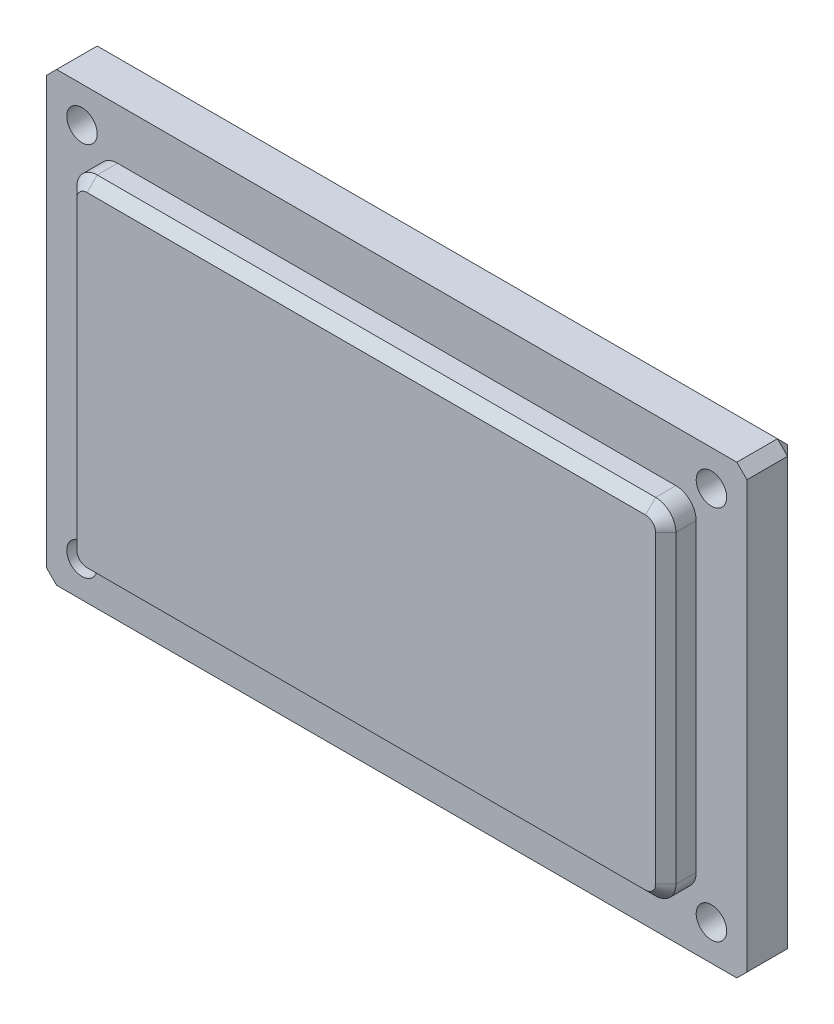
ISO-10303-21;
HEADER;
FILE_DESCRIPTION(('STEP AP214'),'2;1');
FILE_NAME('part.step','',(''),(''),'','','');
FILE_SCHEMA(('AUTOMOTIVE_DESIGN { 1 0 10303 214 1 1 1 1 }'));
ENDSEC;
DATA;
#1=APPLICATION_CONTEXT('core data for automotive mechanical design processes');
#2=APPLICATION_PROTOCOL_DEFINITION('international standard','automotive_design',2000,#1);
#3=PRODUCT_CONTEXT('',#1,'mechanical');
#4=PRODUCT('Part','Part','',(#3));
#5=PRODUCT_RELATED_PRODUCT_CATEGORY('part','',(#4));
#6=PRODUCT_DEFINITION_FORMATION('','',#4);
#7=PRODUCT_DEFINITION_CONTEXT('part definition',#1,'design');
#8=PRODUCT_DEFINITION('design','',#6,#7);
#9=PRODUCT_DEFINITION_SHAPE('','',#8);
#10=(LENGTH_UNIT() NAMED_UNIT(*) SI_UNIT(.MILLI.,.METRE.));
#11=(NAMED_UNIT(*) PLANE_ANGLE_UNIT() SI_UNIT($,.RADIAN.));
#12=(NAMED_UNIT(*) SI_UNIT($,.STERADIAN.) SOLID_ANGLE_UNIT());
#13=UNCERTAINTY_MEASURE_WITH_UNIT(LENGTH_MEASURE(1.E-05),#10,'distance_accuracy_value','');
#14=(GEOMETRIC_REPRESENTATION_CONTEXT(3) GLOBAL_UNCERTAINTY_ASSIGNED_CONTEXT((#13)) GLOBAL_UNIT_ASSIGNED_CONTEXT((#10,
#11,#12)) REPRESENTATION_CONTEXT('',''));
#15=CARTESIAN_POINT('',(0.,0.,0.));
#16=DIRECTION('',(0.,0.,1.));
#17=DIRECTION('',(1.,0.,0.));
#18=AXIS2_PLACEMENT_3D('',#15,#16,#17);
#19=CARTESIAN_POINT('',(34.5,22.,8.));
#20=DIRECTION('',(-1.,0.,0.));
#21=DIRECTION('',(0.,0.,1.));
#22=AXIS2_PLACEMENT_3D('',#19,#20,#21);
#23=PLANE('',#22);
#24=DIRECTION('',(0.,1.,0.));
#25=VECTOR('',#24,1.);
#26=CARTESIAN_POINT('',(34.5,22.,1.00000000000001));
#27=LINE('',#26,#25);
#28=CARTESIAN_POINT('',(34.5,-21.,1.00000000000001));
#29=VERTEX_POINT('',#28);
#30=CARTESIAN_POINT('',(34.5,21.,1.00000000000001));
#31=VERTEX_POINT('',#30);
#32=EDGE_CURVE('E334',#29,#31,#27,.T.);
#33=ORIENTED_EDGE('',*,*,#32,.T.);
#34=DIRECTION('',(0.,0.,1.));
#35=VECTOR('',#34,1.);
#36=CARTESIAN_POINT('',(34.5,21.,8.));
#37=LINE('',#36,#35);
#38=CARTESIAN_POINT('',(34.5,21.,5.));
#39=VERTEX_POINT('',#38);
#40=EDGE_CURVE('E337',#31,#39,#37,.T.);
#41=ORIENTED_EDGE('',*,*,#40,.T.);
#42=DIRECTION('',(0.,1.,0.));
#43=VECTOR('',#42,1.);
#44=CARTESIAN_POINT('',(34.5,22.,5.));
#45=LINE('',#44,#43);
#46=CARTESIAN_POINT('',(34.5,-21.,5.));
#47=VERTEX_POINT('',#46);
#48=EDGE_CURVE('E437',#47,#39,#45,.T.);
#49=ORIENTED_EDGE('',*,*,#48,.F.);
#50=DIRECTION('',(0.,0.,-1.));
#51=VECTOR('',#50,1.);
#52=CARTESIAN_POINT('',(34.5,-21.,8.));
#53=LINE('',#52,#51);
#54=EDGE_CURVE('E331',#47,#29,#53,.T.);
#55=ORIENTED_EDGE('',*,*,#54,.T.);
#56=EDGE_LOOP('',(#33,#41,#49,#55));
#57=FACE_BOUND('',#56,.T.);
#58=ADVANCED_FACE('F43',(#57),#23,.F.);
#59=CARTESIAN_POINT('',(-34.5,22.,8.));
#60=DIRECTION('',(0.,-1.,0.));
#61=DIRECTION('',(0.,0.,-1.));
#62=AXIS2_PLACEMENT_3D('',#59,#60,#61);
#63=PLANE('',#62);
#64=DIRECTION('',(-1.,0.,0.));
#65=VECTOR('',#64,1.);
#66=CARTESIAN_POINT('',(-34.5,22.,1.00000000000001));
#67=LINE('',#66,#65);
#68=CARTESIAN_POINT('',(33.5,22.,1.00000000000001));
#69=VERTEX_POINT('',#68);
#70=CARTESIAN_POINT('',(-33.5,22.,1.00000000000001));
#71=VERTEX_POINT('',#70);
#72=EDGE_CURVE('E300',#69,#71,#67,.T.);
#73=ORIENTED_EDGE('',*,*,#72,.T.);
#74=DIRECTION('',(0.,0.,1.));
#75=VECTOR('',#74,1.);
#76=CARTESIAN_POINT('',(-33.5,22.,8.));
#77=LINE('',#76,#75);
#78=CARTESIAN_POINT('',(-33.5,22.,5.));
#79=VERTEX_POINT('',#78);
#80=EDGE_CURVE('E303',#71,#79,#77,.T.);
#81=ORIENTED_EDGE('',*,*,#80,.T.);
#82=DIRECTION('',(-1.,0.,0.));
#83=VECTOR('',#82,1.);
#84=CARTESIAN_POINT('',(-34.5,22.,5.));
#85=LINE('',#84,#83);
#86=CARTESIAN_POINT('',(33.5,22.,5.));
#87=VERTEX_POINT('',#86);
#88=EDGE_CURVE('E207',#87,#79,#85,.T.);
#89=ORIENTED_EDGE('',*,*,#88,.F.);
#90=DIRECTION('',(0.,0.,-1.));
#91=VECTOR('',#90,1.);
#92=CARTESIAN_POINT('',(33.5,22.,8.));
#93=LINE('',#92,#91);
#94=EDGE_CURVE('E297',#87,#69,#93,.T.);
#95=ORIENTED_EDGE('',*,*,#94,.T.);
#96=EDGE_LOOP('',(#73,#81,#89,#95));
#97=FACE_BOUND('',#96,.T.);
#98=ADVANCED_FACE('F572',(#97),#63,.F.);
#99=CARTESIAN_POINT('',(-34.5,22.,8.));
#100=DIRECTION('',(1.,0.,0.));
#101=DIRECTION('',(0.,0.,-1.));
#102=AXIS2_PLACEMENT_3D('',#99,#100,#101);
#103=PLANE('',#102);
#104=DIRECTION('',(0.,-1.,0.));
#105=VECTOR('',#104,1.);
#106=CARTESIAN_POINT('',(-34.5,-22.,5.));
#107=LINE('',#106,#105);
#108=CARTESIAN_POINT('',(-34.5,21.,5.));
#109=VERTEX_POINT('',#108);
#110=CARTESIAN_POINT('',(-34.5,-21.,5.));
#111=VERTEX_POINT('',#110);
#112=EDGE_CURVE('E438',#109,#111,#107,.T.);
#113=ORIENTED_EDGE('',*,*,#112,.F.);
#114=DIRECTION('',(0.,0.,-1.));
#115=VECTOR('',#114,1.);
#116=CARTESIAN_POINT('',(-34.5,21.,8.));
#117=LINE('',#116,#115);
#118=CARTESIAN_POINT('',(-34.5,21.,1.00000000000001));
#119=VERTEX_POINT('',#118);
#120=EDGE_CURVE('E293',#109,#119,#117,.T.);
#121=ORIENTED_EDGE('',*,*,#120,.T.);
#122=DIRECTION('',(0.,-1.,0.));
#123=VECTOR('',#122,1.);
#124=CARTESIAN_POINT('',(-34.5,22.,1.00000000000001));
#125=LINE('',#124,#123);
#126=CARTESIAN_POINT('',(-34.5,-21.,1.00000000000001));
#127=VERTEX_POINT('',#126);
#128=EDGE_CURVE('E287',#119,#127,#125,.T.);
#129=ORIENTED_EDGE('',*,*,#128,.T.);
#130=DIRECTION('',(0.,0.,1.));
#131=VECTOR('',#130,1.);
#132=CARTESIAN_POINT('',(-34.5,-21.,8.));
#133=LINE('',#132,#131);
#134=EDGE_CURVE('E290',#127,#111,#133,.T.);
#135=ORIENTED_EDGE('',*,*,#134,.T.);
#136=EDGE_LOOP('',(#113,#121,#129,#135));
#137=FACE_BOUND('',#136,.T.);
#138=ADVANCED_FACE('F578',(#137),#103,.F.);
#139=CARTESIAN_POINT('',(-34.5,-22.,8.));
#140=DIRECTION('',(0.,1.,0.));
#141=DIRECTION('',(0.,0.,1.));
#142=AXIS2_PLACEMENT_3D('',#139,#140,#141);
#143=PLANE('',#142);
#144=DIRECTION('',(1.,0.,0.));
#145=VECTOR('',#144,1.);
#146=CARTESIAN_POINT('',(-34.5,-22.,1.00000000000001));
#147=LINE('',#146,#145);
#148=CARTESIAN_POINT('',(-33.5,-22.,1.00000000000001));
#149=VERTEX_POINT('',#148);
#150=CARTESIAN_POINT('',(33.5,-22.,1.00000000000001));
#151=VERTEX_POINT('',#150);
#152=EDGE_CURVE('E54',#149,#151,#147,.T.);
#153=ORIENTED_EDGE('',*,*,#152,.T.);
#154=DIRECTION('',(0.,0.,1.));
#155=VECTOR('',#154,1.);
#156=CARTESIAN_POINT('',(33.5,-22.,8.));
#157=LINE('',#156,#155);
#158=CARTESIAN_POINT('',(33.5,-22.,5.));
#159=VERTEX_POINT('',#158);
#160=EDGE_CURVE('E11',#151,#159,#157,.T.);
#161=ORIENTED_EDGE('',*,*,#160,.T.);
#162=DIRECTION('',(1.,0.,0.));
#163=VECTOR('',#162,1.);
#164=CARTESIAN_POINT('',(34.5,-22.,5.));
#165=LINE('',#164,#163);
#166=CARTESIAN_POINT('',(-33.5,-22.,5.));
#167=VERTEX_POINT('',#166);
#168=EDGE_CURVE('E430',#167,#159,#165,.T.);
#169=ORIENTED_EDGE('',*,*,#168,.F.);
#170=DIRECTION('',(0.,0.,-1.));
#171=VECTOR('',#170,1.);
#172=CARTESIAN_POINT('',(-33.5,-22.,8.));
#173=LINE('',#172,#171);
#174=EDGE_CURVE('E65',#167,#149,#173,.T.);
#175=ORIENTED_EDGE('',*,*,#174,.T.);
#176=EDGE_LOOP('',(#153,#161,#169,#175));
#177=FACE_BOUND('',#176,.T.);
#178=ADVANCED_FACE('F429',(#177),#143,.F.);
#179=CARTESIAN_POINT('',(0.,0.,0.));
#180=DIRECTION('',(0.,0.,1.));
#181=DIRECTION('',(1.,0.,0.));
#182=AXIS2_PLACEMENT_3D('',#179,#180,#181);
#183=PLANE('',#182);
#184=DIRECTION('',(0.,1.,0.));
#185=VECTOR('',#184,1.);
#186=CARTESIAN_POINT('',(-33.5,0.,0.));
#187=LINE('',#186,#185);
#188=CARTESIAN_POINT('',(-33.5,-21.,0.));
#189=VERTEX_POINT('',#188);
#190=CARTESIAN_POINT('',(-33.5,21.,0.));
#191=VERTEX_POINT('',#190);
#192=EDGE_CURVE('E318',#189,#191,#187,.T.);
#193=ORIENTED_EDGE('',*,*,#192,.T.);
#194=DIRECTION('',(1.,0.,0.));
#195=VECTOR('',#194,1.);
#196=CARTESIAN_POINT('',(0.,21.,0.));
#197=LINE('',#196,#195);
#198=CARTESIAN_POINT('',(33.5,21.,0.));
#199=VERTEX_POINT('',#198);
#200=EDGE_CURVE('E327',#191,#199,#197,.T.);
#201=ORIENTED_EDGE('',*,*,#200,.T.);
#202=DIRECTION('',(0.,-1.,0.));
#203=VECTOR('',#202,1.);
#204=CARTESIAN_POINT('',(33.5,0.,0.));
#205=LINE('',#204,#203);
#206=CARTESIAN_POINT('',(33.5,-21.,0.));
#207=VERTEX_POINT('',#206);
#208=EDGE_CURVE('E324',#199,#207,#205,.T.);
#209=ORIENTED_EDGE('',*,*,#208,.T.);
#210=DIRECTION('',(-1.,0.,0.));
#211=VECTOR('',#210,1.);
#212=CARTESIAN_POINT('',(0.,-21.,0.));
#213=LINE('',#212,#211);
#214=EDGE_CURVE('E321',#207,#189,#213,.T.);
#215=ORIENTED_EDGE('',*,*,#214,.T.);
#216=EDGE_LOOP('',(#193,#201,#209,#215));
#217=FACE_BOUND('',#216,.T.);
#218=CARTESIAN_POINT('',(-31.,-18.5,0.));
#219=DIRECTION('',(0.,0.,1.));
#220=DIRECTION('',(-1.,0.,0.));
#221=AXIS2_PLACEMENT_3D('',#218,#219,#220);
#222=CIRCLE('',#221,1.5);
#223=CARTESIAN_POINT('',(-32.5,-18.5,0.));
#224=VERTEX_POINT('',#223);
#225=EDGE_CURVE('E516',#224,#224,#222,.T.);
#226=ORIENTED_EDGE('',*,*,#225,.T.);
#227=EDGE_LOOP('',(#226));
#228=FACE_BOUND('',#227,.T.);
#229=CARTESIAN_POINT('',(31.,18.5,0.));
#230=DIRECTION('',(0.,0.,1.));
#231=DIRECTION('',(-1.,0.,0.));
#232=AXIS2_PLACEMENT_3D('',#229,#230,#231);
#233=CIRCLE('',#232,1.50000000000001);
#234=CARTESIAN_POINT('',(29.5,18.5,0.));
#235=VERTEX_POINT('',#234);
#236=EDGE_CURVE('E524',#235,#235,#233,.T.);
#237=ORIENTED_EDGE('',*,*,#236,.T.);
#238=EDGE_LOOP('',(#237));
#239=FACE_BOUND('',#238,.T.);
#240=CARTESIAN_POINT('',(31.,-18.5,0.));
#241=DIRECTION('',(0.,0.,1.));
#242=DIRECTION('',(1.,0.,0.));
#243=AXIS2_PLACEMENT_3D('',#240,#241,#242);
#244=CIRCLE('',#243,1.50000000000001);
#245=CARTESIAN_POINT('',(32.5,-18.5,0.));
#246=VERTEX_POINT('',#245);
#247=EDGE_CURVE('E525',#246,#246,#244,.T.);
#248=ORIENTED_EDGE('',*,*,#247,.T.);
#249=EDGE_LOOP('',(#248));
#250=FACE_BOUND('',#249,.T.);
#251=CARTESIAN_POINT('',(-31.,18.5,0.));
#252=DIRECTION('',(0.,0.,1.));
#253=DIRECTION('',(1.,0.,0.));
#254=AXIS2_PLACEMENT_3D('',#251,#252,#253);
#255=CIRCLE('',#254,1.5);
#256=CARTESIAN_POINT('',(-29.5,18.5,0.));
#257=VERTEX_POINT('',#256);
#258=EDGE_CURVE('E511',#257,#257,#255,.T.);
#259=ORIENTED_EDGE('',*,*,#258,.T.);
#260=EDGE_LOOP('',(#259));
#261=FACE_BOUND('',#260,.T.);
#262=ADVANCED_FACE('F543',(#217,#228,#239,#250,#261),#183,.F.);
#263=CARTESIAN_POINT('',(0.,0.,5.));
#264=DIRECTION('',(0.,0.,-1.));
#265=DIRECTION('',(-1.,0.,0.));
#266=AXIS2_PLACEMENT_3D('',#263,#264,#265);
#267=PLANE('',#266);
#268=CARTESIAN_POINT('',(-31.,-18.5,5.));
#269=DIRECTION('',(0.,0.,1.));
#270=DIRECTION('',(-1.,0.,0.));
#271=AXIS2_PLACEMENT_3D('',#268,#269,#270);
#272=CIRCLE('',#271,1.5);
#273=CARTESIAN_POINT('',(-32.5,-18.5,5.));
#274=VERTEX_POINT('',#273);
#275=EDGE_CURVE('E529',#274,#274,#272,.T.);
#276=ORIENTED_EDGE('',*,*,#275,.F.);
#277=EDGE_LOOP('',(#276));
#278=FACE_BOUND('',#277,.T.);
#279=CARTESIAN_POINT('',(31.,18.5,5.));
#280=DIRECTION('',(0.,0.,1.));
#281=DIRECTION('',(-1.,0.,0.));
#282=AXIS2_PLACEMENT_3D('',#279,#280,#281);
#283=CIRCLE('',#282,1.50000000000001);
#284=CARTESIAN_POINT('',(29.5,18.5,5.));
#285=VERTEX_POINT('',#284);
#286=EDGE_CURVE('E520',#285,#285,#283,.T.);
#287=ORIENTED_EDGE('',*,*,#286,.F.);
#288=EDGE_LOOP('',(#287));
#289=FACE_BOUND('',#288,.T.);
#290=CARTESIAN_POINT('',(31.,-18.5,5.));
#291=DIRECTION('',(0.,0.,1.));
#292=DIRECTION('',(1.,0.,0.));
#293=AXIS2_PLACEMENT_3D('',#290,#291,#292);
#294=CIRCLE('',#293,1.50000000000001);
#295=CARTESIAN_POINT('',(32.5,-18.5,5.));
#296=VERTEX_POINT('',#295);
#297=EDGE_CURVE('E374',#296,#296,#294,.T.);
#298=ORIENTED_EDGE('',*,*,#297,.F.);
#299=EDGE_LOOP('',(#298));
#300=FACE_BOUND('',#299,.T.);
#301=CARTESIAN_POINT('',(-31.,18.5,5.));
#302=DIRECTION('',(0.,0.,1.));
#303=DIRECTION('',(1.,0.,0.));
#304=AXIS2_PLACEMENT_3D('',#301,#302,#303);
#305=CIRCLE('',#304,1.5);
#306=CARTESIAN_POINT('',(-29.5,18.5,5.));
#307=VERTEX_POINT('',#306);
#308=EDGE_CURVE('E512',#307,#307,#305,.T.);
#309=ORIENTED_EDGE('',*,*,#308,.F.);
#310=EDGE_LOOP('',(#309));
#311=FACE_BOUND('',#310,.T.);
#312=DIRECTION('',(0.,-1.,0.));
#313=VECTOR('',#312,1.);
#314=CARTESIAN_POINT('',(-29.5,17.,5.));
#315=LINE('',#314,#313);
#316=CARTESIAN_POINT('',(-29.5,15.,5.));
#317=VERTEX_POINT('',#316);
#318=CARTESIAN_POINT('',(-29.5,-15.,5.));
#319=VERTEX_POINT('',#318);
#320=EDGE_CURVE('E220',#317,#319,#315,.T.);
#321=ORIENTED_EDGE('',*,*,#320,.F.);
#322=CARTESIAN_POINT('',(-27.5,15.,5.));
#323=DIRECTION('',(0.,0.,-1.));
#324=DIRECTION('',(-1.,0.,0.));
#325=AXIS2_PLACEMENT_3D('',#322,#323,#324);
#326=CIRCLE('',#325,2.);
#327=CARTESIAN_POINT('',(-27.5,17.,5.));
#328=VERTEX_POINT('',#327);
#329=EDGE_CURVE('E227',#317,#328,#326,.T.);
#330=ORIENTED_EDGE('',*,*,#329,.T.);
#331=DIRECTION('',(-1.,0.,0.));
#332=VECTOR('',#331,1.);
#333=CARTESIAN_POINT('',(-29.5,17.,5.));
#334=LINE('',#333,#332);
#335=CARTESIAN_POINT('',(27.5,17.,5.));
#336=VERTEX_POINT('',#335);
#337=EDGE_CURVE('E443',#336,#328,#334,.T.);
#338=ORIENTED_EDGE('',*,*,#337,.F.);
#339=CARTESIAN_POINT('',(27.5,15.,5.));
#340=DIRECTION('',(0.,0.,-1.));
#341=DIRECTION('',(-1.,0.,0.));
#342=AXIS2_PLACEMENT_3D('',#339,#340,#341);
#343=CIRCLE('',#342,2.);
#344=CARTESIAN_POINT('',(29.5,15.,5.));
#345=VERTEX_POINT('',#344);
#346=EDGE_CURVE('E231',#336,#345,#343,.T.);
#347=ORIENTED_EDGE('',*,*,#346,.T.);
#348=DIRECTION('',(0.,1.,0.));
#349=VECTOR('',#348,1.);
#350=CARTESIAN_POINT('',(29.5,17.,5.));
#351=LINE('',#350,#349);
#352=CARTESIAN_POINT('',(29.5,-15.,5.));
#353=VERTEX_POINT('',#352);
#354=EDGE_CURVE('E219',#353,#345,#351,.T.);
#355=ORIENTED_EDGE('',*,*,#354,.F.);
#356=CARTESIAN_POINT('',(27.5,-15.,5.));
#357=DIRECTION('',(0.,0.,-1.));
#358=DIRECTION('',(-1.,0.,0.));
#359=AXIS2_PLACEMENT_3D('',#356,#357,#358);
#360=CIRCLE('',#359,2.);
#361=CARTESIAN_POINT('',(27.5,-17.,5.));
#362=VERTEX_POINT('',#361);
#363=EDGE_CURVE('E217',#353,#362,#360,.T.);
#364=ORIENTED_EDGE('',*,*,#363,.T.);
#365=DIRECTION('',(1.,0.,0.));
#366=VECTOR('',#365,1.);
#367=CARTESIAN_POINT('',(-29.5,-17.,5.));
#368=LINE('',#367,#366);
#369=CARTESIAN_POINT('',(-27.5,-17.,5.));
#370=VERTEX_POINT('',#369);
#371=EDGE_CURVE('E197',#370,#362,#368,.T.);
#372=ORIENTED_EDGE('',*,*,#371,.F.);
#373=CARTESIAN_POINT('',(-27.5,-15.,5.));
#374=DIRECTION('',(0.,0.,-1.));
#375=DIRECTION('',(-1.,0.,0.));
#376=AXIS2_PLACEMENT_3D('',#373,#374,#375);
#377=CIRCLE('',#376,2.);
#378=EDGE_CURVE('E213',#370,#319,#377,.T.);
#379=ORIENTED_EDGE('',*,*,#378,.T.);
#380=EDGE_LOOP('',(#321,#330,#338,#347,#355,#364,#372,#379));
#381=FACE_BOUND('',#380,.T.);
#382=ORIENTED_EDGE('',*,*,#88,.T.);
#383=DIRECTION('',(0.707106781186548,0.707106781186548,0.));
#384=VECTOR('',#383,1.);
#385=CARTESIAN_POINT('',(-34.5,21.,5.));
#386=LINE('',#385,#384);
#387=EDGE_CURVE('E315',#79,#109,#386,.F.);
#388=ORIENTED_EDGE('',*,*,#387,.T.);
#389=ORIENTED_EDGE('',*,*,#112,.T.);
#390=DIRECTION('',(-0.707106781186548,0.707106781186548,0.));
#391=VECTOR('',#390,1.);
#392=CARTESIAN_POINT('',(-33.5,-22.,5.));
#393=LINE('',#392,#391);
#394=EDGE_CURVE('E306',#111,#167,#393,.F.);
#395=ORIENTED_EDGE('',*,*,#394,.T.);
#396=ORIENTED_EDGE('',*,*,#168,.T.);
#397=DIRECTION('',(-0.707106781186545,-0.70710678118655,0.));
#398=VECTOR('',#397,1.);
#399=CARTESIAN_POINT('',(34.5,-21.,5.));
#400=LINE('',#399,#398);
#401=EDGE_CURVE('E309',#159,#47,#400,.F.);
#402=ORIENTED_EDGE('',*,*,#401,.T.);
#403=ORIENTED_EDGE('',*,*,#48,.T.);
#404=DIRECTION('',(0.707106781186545,-0.70710678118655,0.));
#405=VECTOR('',#404,1.);
#406=CARTESIAN_POINT('',(33.5,22.,5.));
#407=LINE('',#406,#405);
#408=EDGE_CURVE('E312',#39,#87,#407,.F.);
#409=ORIENTED_EDGE('',*,*,#408,.T.);
#410=EDGE_LOOP('',(#382,#388,#389,#395,#396,#402,#403,#409));
#411=FACE_BOUND('',#410,.T.);
#412=ADVANCED_FACE('F211',(#278,#289,#300,#311,#381,#411),#267,.F.);
#413=CARTESIAN_POINT('',(-29.5,17.,5.));
#414=DIRECTION('',(-1.,0.,0.));
#415=DIRECTION('',(0.,-1.,0.));
#416=AXIS2_PLACEMENT_3D('',#413,#414,#415);
#417=PLANE('',#416);
#418=DIRECTION('',(0.,0.,1.));
#419=VECTOR('',#418,1.);
#420=CARTESIAN_POINT('',(-29.5,-15.,5.));
#421=LINE('',#420,#419);
#422=CARTESIAN_POINT('',(-29.5,-15.,7.00000000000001));
#423=VERTEX_POINT('',#422);
#424=EDGE_CURVE('E225',#319,#423,#421,.T.);
#425=ORIENTED_EDGE('',*,*,#424,.T.);
#426=DIRECTION('',(0.,1.,0.));
#427=VECTOR('',#426,1.);
#428=CARTESIAN_POINT('',(-29.5,17.,7.00000000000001));
#429=LINE('',#428,#427);
#430=CARTESIAN_POINT('',(-29.5,15.,7.00000000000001));
#431=VERTEX_POINT('',#430);
#432=EDGE_CURVE('E267',#423,#431,#429,.T.);
#433=ORIENTED_EDGE('',*,*,#432,.T.);
#434=DIRECTION('',(0.,0.,1.));
#435=VECTOR('',#434,1.);
#436=CARTESIAN_POINT('',(-29.5,15.,5.));
#437=LINE('',#436,#435);
#438=EDGE_CURVE('E458',#431,#317,#437,.F.);
#439=ORIENTED_EDGE('',*,*,#438,.T.);
#440=ORIENTED_EDGE('',*,*,#320,.T.);
#441=EDGE_LOOP('',(#425,#433,#439,#440));
#442=FACE_BOUND('',#441,.T.);
#443=ADVANCED_FACE('F556',(#442),#417,.T.);
#444=CARTESIAN_POINT('',(-29.5,17.,5.));
#445=DIRECTION('',(0.,1.,0.));
#446=DIRECTION('',(0.,0.,1.));
#447=AXIS2_PLACEMENT_3D('',#444,#445,#446);
#448=PLANE('',#447);
#449=DIRECTION('',(0.,0.,1.));
#450=VECTOR('',#449,1.);
#451=CARTESIAN_POINT('',(-27.5,17.,5.));
#452=LINE('',#451,#450);
#453=CARTESIAN_POINT('',(-27.5,17.,7.00000000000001));
#454=VERTEX_POINT('',#453);
#455=EDGE_CURVE('E233',#328,#454,#452,.T.);
#456=ORIENTED_EDGE('',*,*,#455,.T.);
#457=DIRECTION('',(1.,0.,0.));
#458=VECTOR('',#457,1.);
#459=CARTESIAN_POINT('',(-29.5,17.,7.00000000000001));
#460=LINE('',#459,#458);
#461=CARTESIAN_POINT('',(27.5,17.,7.00000000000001));
#462=VERTEX_POINT('',#461);
#463=EDGE_CURVE('E273',#454,#462,#460,.T.);
#464=ORIENTED_EDGE('',*,*,#463,.T.);
#465=DIRECTION('',(0.,0.,1.));
#466=VECTOR('',#465,1.);
#467=CARTESIAN_POINT('',(27.5,17.,5.));
#468=LINE('',#467,#466);
#469=EDGE_CURVE('E463',#462,#336,#468,.F.);
#470=ORIENTED_EDGE('',*,*,#469,.T.);
#471=ORIENTED_EDGE('',*,*,#337,.T.);
#472=EDGE_LOOP('',(#456,#464,#470,#471));
#473=FACE_BOUND('',#472,.T.);
#474=ADVANCED_FACE('F471',(#473),#448,.T.);
#475=CARTESIAN_POINT('',(29.5,17.,5.));
#476=DIRECTION('',(1.,0.,0.));
#477=DIRECTION('',(0.,0.,-1.));
#478=AXIS2_PLACEMENT_3D('',#475,#476,#477);
#479=PLANE('',#478);
#480=DIRECTION('',(0.,0.,1.));
#481=VECTOR('',#480,1.);
#482=CARTESIAN_POINT('',(29.5,15.,5.));
#483=LINE('',#482,#481);
#484=CARTESIAN_POINT('',(29.5,15.,7.00000000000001));
#485=VERTEX_POINT('',#484);
#486=EDGE_CURVE('E451',#345,#485,#483,.T.);
#487=ORIENTED_EDGE('',*,*,#486,.T.);
#488=DIRECTION('',(0.,-1.,0.));
#489=VECTOR('',#488,1.);
#490=CARTESIAN_POINT('',(29.5,17.,7.00000000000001));
#491=LINE('',#490,#489);
#492=CARTESIAN_POINT('',(29.5,-15.,7.00000000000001));
#493=VERTEX_POINT('',#492);
#494=EDGE_CURVE('E279',#485,#493,#491,.T.);
#495=ORIENTED_EDGE('',*,*,#494,.T.);
#496=DIRECTION('',(0.,0.,1.));
#497=VECTOR('',#496,1.);
#498=CARTESIAN_POINT('',(29.5,-15.,5.));
#499=LINE('',#498,#497);
#500=EDGE_CURVE('E455',#493,#353,#499,.F.);
#501=ORIENTED_EDGE('',*,*,#500,.T.);
#502=ORIENTED_EDGE('',*,*,#354,.T.);
#503=EDGE_LOOP('',(#487,#495,#501,#502));
#504=FACE_BOUND('',#503,.T.);
#505=ADVANCED_FACE('F503',(#504),#479,.T.);
#506=CARTESIAN_POINT('',(-29.5,-17.,5.));
#507=DIRECTION('',(0.,-1.,0.));
#508=DIRECTION('',(1.,0.,0.));
#509=AXIS2_PLACEMENT_3D('',#506,#507,#508);
#510=PLANE('',#509);
#511=DIRECTION('',(0.,0.,1.));
#512=VECTOR('',#511,1.);
#513=CARTESIAN_POINT('',(27.5,-17.,5.));
#514=LINE('',#513,#512);
#515=CARTESIAN_POINT('',(27.5,-17.,7.00000000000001));
#516=VERTEX_POINT('',#515);
#517=EDGE_CURVE('E206',#362,#516,#514,.T.);
#518=ORIENTED_EDGE('',*,*,#517,.T.);
#519=DIRECTION('',(-1.,0.,0.));
#520=VECTOR('',#519,1.);
#521=CARTESIAN_POINT('',(-29.5,-17.,7.00000000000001));
#522=LINE('',#521,#520);
#523=CARTESIAN_POINT('',(-27.5,-17.,7.00000000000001));
#524=VERTEX_POINT('',#523);
#525=EDGE_CURVE('E200',#516,#524,#522,.T.);
#526=ORIENTED_EDGE('',*,*,#525,.T.);
#527=DIRECTION('',(0.,0.,1.));
#528=VECTOR('',#527,1.);
#529=CARTESIAN_POINT('',(-27.5,-17.,5.));
#530=LINE('',#529,#528);
#531=EDGE_CURVE('E193',#524,#370,#530,.F.);
#532=ORIENTED_EDGE('',*,*,#531,.T.);
#533=ORIENTED_EDGE('',*,*,#371,.T.);
#534=EDGE_LOOP('',(#518,#526,#532,#533));
#535=FACE_BOUND('',#534,.T.);
#536=ADVANCED_FACE('F196',(#535),#510,.T.);
#537=CARTESIAN_POINT('',(0.,0.,8.));
#538=DIRECTION('',(0.,0.,1.));
#539=DIRECTION('',(1.,0.,0.));
#540=AXIS2_PLACEMENT_3D('',#537,#538,#539);
#541=PLANE('',#540);
#542=DIRECTION('',(0.,-1.,0.));
#543=VECTOR('',#542,1.);
#544=CARTESIAN_POINT('',(-28.5,0.,8.));
#545=LINE('',#544,#543);
#546=CARTESIAN_POINT('',(-28.5,15.,8.));
#547=VERTEX_POINT('',#546);
#548=CARTESIAN_POINT('',(-28.5,-15.,8.));
#549=VERTEX_POINT('',#548);
#550=EDGE_CURVE('E257',#547,#549,#545,.T.);
#551=ORIENTED_EDGE('',*,*,#550,.T.);
#552=CARTESIAN_POINT('',(-27.5,-15.,8.));
#553=DIRECTION('',(0.,0.,1.));
#554=DIRECTION('',(1.,0.,0.));
#555=AXIS2_PLACEMENT_3D('',#552,#553,#554);
#556=CIRCLE('',#555,1.00000000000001);
#557=CARTESIAN_POINT('',(-27.5,-16.,8.));
#558=VERTEX_POINT('',#557);
#559=EDGE_CURVE('E260',#549,#558,#556,.T.);
#560=ORIENTED_EDGE('',*,*,#559,.T.);
#561=DIRECTION('',(1.,0.,0.));
#562=VECTOR('',#561,1.);
#563=CARTESIAN_POINT('',(0.,-16.,8.));
#564=LINE('',#563,#562);
#565=CARTESIAN_POINT('',(27.5,-16.,8.));
#566=VERTEX_POINT('',#565);
#567=EDGE_CURVE('E239',#558,#566,#564,.T.);
#568=ORIENTED_EDGE('',*,*,#567,.T.);
#569=CARTESIAN_POINT('',(27.5,-15.,8.));
#570=DIRECTION('',(0.,0.,1.));
#571=DIRECTION('',(1.,0.,0.));
#572=AXIS2_PLACEMENT_3D('',#569,#570,#571);
#573=CIRCLE('',#572,1.00000000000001);
#574=CARTESIAN_POINT('',(28.5,-15.,8.));
#575=VERTEX_POINT('',#574);
#576=EDGE_CURVE('E242',#566,#575,#573,.T.);
#577=ORIENTED_EDGE('',*,*,#576,.T.);
#578=DIRECTION('',(0.,1.,0.));
#579=VECTOR('',#578,1.);
#580=CARTESIAN_POINT('',(28.5,0.,8.));
#581=LINE('',#580,#579);
#582=CARTESIAN_POINT('',(28.5,15.,8.));
#583=VERTEX_POINT('',#582);
#584=EDGE_CURVE('E245',#575,#583,#581,.T.);
#585=ORIENTED_EDGE('',*,*,#584,.T.);
#586=CARTESIAN_POINT('',(27.5,15.,8.));
#587=DIRECTION('',(0.,0.,1.));
#588=DIRECTION('',(1.,0.,0.));
#589=AXIS2_PLACEMENT_3D('',#586,#587,#588);
#590=CIRCLE('',#589,1.00000000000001);
#591=CARTESIAN_POINT('',(27.5,16.,8.));
#592=VERTEX_POINT('',#591);
#593=EDGE_CURVE('E248',#583,#592,#590,.T.);
#594=ORIENTED_EDGE('',*,*,#593,.T.);
#595=DIRECTION('',(-1.,0.,0.));
#596=VECTOR('',#595,1.);
#597=CARTESIAN_POINT('',(0.,16.,8.));
#598=LINE('',#597,#596);
#599=CARTESIAN_POINT('',(-27.5,16.,8.));
#600=VERTEX_POINT('',#599);
#601=EDGE_CURVE('E251',#592,#600,#598,.T.);
#602=ORIENTED_EDGE('',*,*,#601,.T.);
#603=CARTESIAN_POINT('',(-27.5,15.,8.));
#604=DIRECTION('',(0.,0.,1.));
#605=DIRECTION('',(1.,0.,0.));
#606=AXIS2_PLACEMENT_3D('',#603,#604,#605);
#607=CIRCLE('',#606,1.00000000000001);
#608=EDGE_CURVE('E254',#600,#547,#607,.T.);
#609=ORIENTED_EDGE('',*,*,#608,.T.);
#610=EDGE_LOOP('',(#551,#560,#568,#577,#585,#594,#602,#609));
#611=FACE_BOUND('',#610,.T.);
#612=ADVANCED_FACE('F488',(#611),#541,.T.);
#613=CARTESIAN_POINT('',(-31.,18.5,0.));
#614=DIRECTION('',(0.,0.,1.));
#615=DIRECTION('',(1.,0.,0.));
#616=AXIS2_PLACEMENT_3D('',#613,#614,#615);
#617=CYLINDRICAL_SURFACE('',#616,1.5);
#618=ORIENTED_EDGE('',*,*,#258,.F.);
#619=EDGE_LOOP('',(#618));
#620=FACE_BOUND('',#619,.T.);
#621=ORIENTED_EDGE('',*,*,#308,.T.);
#622=EDGE_LOOP('',(#621));
#623=FACE_BOUND('',#622,.T.);
#624=ADVANCED_FACE('F550',(#620,#623),#617,.F.);
#625=CARTESIAN_POINT('',(31.,-18.5,0.));
#626=DIRECTION('',(0.,0.,1.));
#627=DIRECTION('',(1.,0.,0.));
#628=AXIS2_PLACEMENT_3D('',#625,#626,#627);
#629=CYLINDRICAL_SURFACE('',#628,1.50000000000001);
#630=ORIENTED_EDGE('',*,*,#247,.F.);
#631=EDGE_LOOP('',(#630));
#632=FACE_BOUND('',#631,.T.);
#633=ORIENTED_EDGE('',*,*,#297,.T.);
#634=EDGE_LOOP('',(#633));
#635=FACE_BOUND('',#634,.T.);
#636=ADVANCED_FACE('F546',(#632,#635),#629,.F.);
#637=CARTESIAN_POINT('',(31.,18.5,0.));
#638=DIRECTION('',(0.,0.,1.));
#639=DIRECTION('',(1.,0.,0.));
#640=AXIS2_PLACEMENT_3D('',#637,#638,#639);
#641=CYLINDRICAL_SURFACE('',#640,1.50000000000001);
#642=ORIENTED_EDGE('',*,*,#236,.F.);
#643=EDGE_LOOP('',(#642));
#644=FACE_BOUND('',#643,.T.);
#645=ORIENTED_EDGE('',*,*,#286,.T.);
#646=EDGE_LOOP('',(#645));
#647=FACE_BOUND('',#646,.T.);
#648=ADVANCED_FACE('F549',(#644,#647),#641,.F.);
#649=CARTESIAN_POINT('',(-31.,-18.5,0.));
#650=DIRECTION('',(0.,0.,1.));
#651=DIRECTION('',(1.,0.,0.));
#652=AXIS2_PLACEMENT_3D('',#649,#650,#651);
#653=CYLINDRICAL_SURFACE('',#652,1.5);
#654=ORIENTED_EDGE('',*,*,#225,.F.);
#655=EDGE_LOOP('',(#654));
#656=FACE_BOUND('',#655,.T.);
#657=ORIENTED_EDGE('',*,*,#275,.T.);
#658=EDGE_LOOP('',(#657));
#659=FACE_BOUND('',#658,.T.);
#660=ADVANCED_FACE('F586',(#656,#659),#653,.F.);
#661=CARTESIAN_POINT('',(27.5,-15.,5.));
#662=DIRECTION('',(0.,0.,1.));
#663=DIRECTION('',(1.,0.,0.));
#664=AXIS2_PLACEMENT_3D('',#661,#662,#663);
#665=CYLINDRICAL_SURFACE('',#664,2.);
#666=ORIENTED_EDGE('',*,*,#500,.F.);
#667=CARTESIAN_POINT('',(27.5,-15.,7.00000000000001));
#668=DIRECTION('',(0.,0.,1.));
#669=DIRECTION('',(1.,0.,0.));
#670=AXIS2_PLACEMENT_3D('',#667,#668,#669);
#671=CIRCLE('',#670,2.);
#672=EDGE_CURVE('E282',#493,#516,#671,.F.);
#673=ORIENTED_EDGE('',*,*,#672,.T.);
#674=ORIENTED_EDGE('',*,*,#517,.F.);
#675=ORIENTED_EDGE('',*,*,#363,.F.);
#676=EDGE_LOOP('',(#666,#673,#674,#675));
#677=FACE_BOUND('',#676,.T.);
#678=ADVANCED_FACE('F583',(#677),#665,.T.);
#679=CARTESIAN_POINT('',(-27.5,-15.,5.));
#680=DIRECTION('',(0.,0.,1.));
#681=DIRECTION('',(1.,0.,0.));
#682=AXIS2_PLACEMENT_3D('',#679,#680,#681);
#683=CYLINDRICAL_SURFACE('',#682,2.);
#684=ORIENTED_EDGE('',*,*,#531,.F.);
#685=CARTESIAN_POINT('',(-27.5,-15.,7.00000000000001));
#686=DIRECTION('',(0.,0.,1.));
#687=DIRECTION('',(1.,0.,0.));
#688=AXIS2_PLACEMENT_3D('',#685,#686,#687);
#689=CIRCLE('',#688,2.);
#690=EDGE_CURVE('E264',#524,#423,#689,.F.);
#691=ORIENTED_EDGE('',*,*,#690,.T.);
#692=ORIENTED_EDGE('',*,*,#424,.F.);
#693=ORIENTED_EDGE('',*,*,#378,.F.);
#694=EDGE_LOOP('',(#684,#691,#692,#693));
#695=FACE_BOUND('',#694,.T.);
#696=ADVANCED_FACE('F223',(#695),#683,.T.);
#697=CARTESIAN_POINT('',(-27.5,15.,5.));
#698=DIRECTION('',(0.,0.,1.));
#699=DIRECTION('',(1.,0.,0.));
#700=AXIS2_PLACEMENT_3D('',#697,#698,#699);
#701=CYLINDRICAL_SURFACE('',#700,2.);
#702=ORIENTED_EDGE('',*,*,#438,.F.);
#703=CARTESIAN_POINT('',(-27.5,15.,7.00000000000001));
#704=DIRECTION('',(0.,0.,1.));
#705=DIRECTION('',(1.,0.,0.));
#706=AXIS2_PLACEMENT_3D('',#703,#704,#705);
#707=CIRCLE('',#706,2.);
#708=EDGE_CURVE('E270',#431,#454,#707,.F.);
#709=ORIENTED_EDGE('',*,*,#708,.T.);
#710=ORIENTED_EDGE('',*,*,#455,.F.);
#711=ORIENTED_EDGE('',*,*,#329,.F.);
#712=EDGE_LOOP('',(#702,#709,#710,#711));
#713=FACE_BOUND('',#712,.T.);
#714=ADVANCED_FACE('F590',(#713),#701,.T.);
#715=CARTESIAN_POINT('',(27.5,15.,5.));
#716=DIRECTION('',(0.,0.,1.));
#717=DIRECTION('',(1.,0.,0.));
#718=AXIS2_PLACEMENT_3D('',#715,#716,#717);
#719=CYLINDRICAL_SURFACE('',#718,2.);
#720=ORIENTED_EDGE('',*,*,#469,.F.);
#721=CARTESIAN_POINT('',(27.5,15.,7.00000000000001));
#722=DIRECTION('',(0.,0.,1.));
#723=DIRECTION('',(1.,0.,0.));
#724=AXIS2_PLACEMENT_3D('',#721,#722,#723);
#725=CIRCLE('',#724,2.);
#726=EDGE_CURVE('E276',#462,#485,#725,.F.);
#727=ORIENTED_EDGE('',*,*,#726,.T.);
#728=ORIENTED_EDGE('',*,*,#486,.F.);
#729=ORIENTED_EDGE('',*,*,#346,.F.);
#730=EDGE_LOOP('',(#720,#727,#728,#729));
#731=FACE_BOUND('',#730,.T.);
#732=ADVANCED_FACE('F499',(#731),#719,.T.);
#733=CARTESIAN_POINT('',(27.5,15.,8.));
#734=DIRECTION('',(0.,0.,-1.));
#735=DIRECTION('',(-1.,0.,0.));
#736=AXIS2_PLACEMENT_3D('',#733,#734,#735);
#737=CONICAL_SURFACE('',#736,1.00000000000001,0.785398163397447);
#738=DIRECTION('',(-0.707106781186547,0.,0.707106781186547));
#739=VECTOR('',#738,1.);
#740=CARTESIAN_POINT('',(29.5,15.,7.00000000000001));
#741=LINE('',#740,#739);
#742=EDGE_CURVE('E366',#485,#583,#741,.T.);
#743=ORIENTED_EDGE('',*,*,#742,.F.);
#744=ORIENTED_EDGE('',*,*,#726,.F.);
#745=DIRECTION('',(0.,0.707106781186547,-0.707106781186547));
#746=VECTOR('',#745,1.);
#747=CARTESIAN_POINT('',(27.5,16.,8.));
#748=LINE('',#747,#746);
#749=EDGE_CURVE('E370',#592,#462,#748,.T.);
#750=ORIENTED_EDGE('',*,*,#749,.F.);
#751=ORIENTED_EDGE('',*,*,#593,.F.);
#752=EDGE_LOOP('',(#743,#744,#750,#751));
#753=FACE_BOUND('',#752,.T.);
#754=ADVANCED_FACE('F495',(#753),#737,.T.);
#755=CARTESIAN_POINT('',(0.,16.,8.));
#756=DIRECTION('',(0.,-0.707106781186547,-0.707106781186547));
#757=DIRECTION('',(-1.,0.,0.));
#758=AXIS2_PLACEMENT_3D('',#755,#756,#757);
#759=PLANE('',#758);
#760=ORIENTED_EDGE('',*,*,#749,.T.);
#761=ORIENTED_EDGE('',*,*,#463,.F.);
#762=DIRECTION('',(0.,0.707106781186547,-0.707106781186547));
#763=VECTOR('',#762,1.);
#764=CARTESIAN_POINT('',(-27.5,16.,8.));
#765=LINE('',#764,#763);
#766=EDGE_CURVE('E362',#600,#454,#765,.T.);
#767=ORIENTED_EDGE('',*,*,#766,.F.);
#768=ORIENTED_EDGE('',*,*,#601,.F.);
#769=EDGE_LOOP('',(#760,#761,#767,#768));
#770=FACE_BOUND('',#769,.T.);
#771=ADVANCED_FACE('F478',(#770),#759,.F.);
#772=CARTESIAN_POINT('',(28.5,0.,8.));
#773=DIRECTION('',(-0.707106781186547,0.,-0.707106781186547));
#774=DIRECTION('',(0.,1.,0.));
#775=AXIS2_PLACEMENT_3D('',#772,#773,#774);
#776=PLANE('',#775);
#777=ORIENTED_EDGE('',*,*,#742,.T.);
#778=ORIENTED_EDGE('',*,*,#584,.F.);
#779=DIRECTION('',(-0.707106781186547,0.,0.707106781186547));
#780=VECTOR('',#779,1.);
#781=CARTESIAN_POINT('',(29.5,-15.,7.00000000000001));
#782=LINE('',#781,#780);
#783=EDGE_CURVE('E358',#493,#575,#782,.T.);
#784=ORIENTED_EDGE('',*,*,#783,.F.);
#785=ORIENTED_EDGE('',*,*,#494,.F.);
#786=EDGE_LOOP('',(#777,#778,#784,#785));
#787=FACE_BOUND('',#786,.T.);
#788=ADVANCED_FACE('F629',(#787),#776,.F.);
#789=CARTESIAN_POINT('',(-27.5,15.,8.));
#790=DIRECTION('',(0.,0.,-1.));
#791=DIRECTION('',(-1.,0.,0.));
#792=AXIS2_PLACEMENT_3D('',#789,#790,#791);
#793=CONICAL_SURFACE('',#792,1.00000000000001,0.785398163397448);
#794=ORIENTED_EDGE('',*,*,#766,.T.);
#795=ORIENTED_EDGE('',*,*,#708,.F.);
#796=DIRECTION('',(-0.707106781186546,0.,-0.707106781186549));
#797=VECTOR('',#796,1.);
#798=CARTESIAN_POINT('',(-28.5,15.,8.));
#799=LINE('',#798,#797);
#800=EDGE_CURVE('E354',#547,#431,#799,.T.);
#801=ORIENTED_EDGE('',*,*,#800,.F.);
#802=ORIENTED_EDGE('',*,*,#608,.F.);
#803=EDGE_LOOP('',(#794,#795,#801,#802));
#804=FACE_BOUND('',#803,.T.);
#805=ADVANCED_FACE('F484',(#804),#793,.T.);
#806=CARTESIAN_POINT('',(27.5,-15.,8.));
#807=DIRECTION('',(0.,0.,-1.));
#808=DIRECTION('',(-1.,0.,0.));
#809=AXIS2_PLACEMENT_3D('',#806,#807,#808);
#810=CONICAL_SURFACE('',#809,1.00000000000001,0.785398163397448);
#811=ORIENTED_EDGE('',*,*,#783,.T.);
#812=ORIENTED_EDGE('',*,*,#576,.F.);
#813=DIRECTION('',(0.,0.707106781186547,0.707106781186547));
#814=VECTOR('',#813,1.);
#815=CARTESIAN_POINT('',(27.5,-17.,7.00000000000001));
#816=LINE('',#815,#814);
#817=EDGE_CURVE('E350',#516,#566,#816,.T.);
#818=ORIENTED_EDGE('',*,*,#817,.F.);
#819=ORIENTED_EDGE('',*,*,#672,.F.);
#820=EDGE_LOOP('',(#811,#812,#818,#819));
#821=FACE_BOUND('',#820,.T.);
#822=ADVANCED_FACE('F616',(#821),#810,.T.);
#823=CARTESIAN_POINT('',(-28.5,0.,8.));
#824=DIRECTION('',(0.707106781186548,0.,-0.707106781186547));
#825=DIRECTION('',(0.,-1.,0.));
#826=AXIS2_PLACEMENT_3D('',#823,#824,#825);
#827=PLANE('',#826);
#828=ORIENTED_EDGE('',*,*,#800,.T.);
#829=ORIENTED_EDGE('',*,*,#432,.F.);
#830=DIRECTION('',(-0.707106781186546,0.,-0.707106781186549));
#831=VECTOR('',#830,1.);
#832=CARTESIAN_POINT('',(-28.5,-15.,8.));
#833=LINE('',#832,#831);
#834=EDGE_CURVE('E347',#549,#423,#833,.T.);
#835=ORIENTED_EDGE('',*,*,#834,.F.);
#836=ORIENTED_EDGE('',*,*,#550,.F.);
#837=EDGE_LOOP('',(#828,#829,#835,#836));
#838=FACE_BOUND('',#837,.T.);
#839=ADVANCED_FACE('F609',(#838),#827,.F.);
#840=CARTESIAN_POINT('',(0.,-16.,8.));
#841=DIRECTION('',(0.,0.707106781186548,-0.707106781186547));
#842=DIRECTION('',(1.,0.,0.));
#843=AXIS2_PLACEMENT_3D('',#840,#841,#842);
#844=PLANE('',#843);
#845=ORIENTED_EDGE('',*,*,#817,.T.);
#846=ORIENTED_EDGE('',*,*,#567,.F.);
#847=DIRECTION('',(0.,0.707106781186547,0.707106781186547));
#848=VECTOR('',#847,1.);
#849=CARTESIAN_POINT('',(-27.5,-17.,7.00000000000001));
#850=LINE('',#849,#848);
#851=EDGE_CURVE('E344',#524,#558,#850,.T.);
#852=ORIENTED_EDGE('',*,*,#851,.F.);
#853=ORIENTED_EDGE('',*,*,#525,.F.);
#854=EDGE_LOOP('',(#845,#846,#852,#853));
#855=FACE_BOUND('',#854,.T.);
#856=ADVANCED_FACE('F602',(#855),#844,.F.);
#857=CARTESIAN_POINT('',(-27.5,-15.,8.));
#858=DIRECTION('',(0.,0.,-1.));
#859=DIRECTION('',(-1.,0.,0.));
#860=AXIS2_PLACEMENT_3D('',#857,#858,#859);
#861=CONICAL_SURFACE('',#860,1.00000000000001,0.785398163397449);
#862=ORIENTED_EDGE('',*,*,#834,.T.);
#863=ORIENTED_EDGE('',*,*,#690,.F.);
#864=ORIENTED_EDGE('',*,*,#851,.T.);
#865=ORIENTED_EDGE('',*,*,#559,.F.);
#866=EDGE_LOOP('',(#862,#863,#864,#865));
#867=FACE_BOUND('',#866,.T.);
#868=ADVANCED_FACE('F596',(#867),#861,.T.);
#869=CARTESIAN_POINT('',(34.5,-21.,8.));
#870=DIRECTION('',(-0.70710678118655,0.707106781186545,0.));
#871=DIRECTION('',(0.,0.,-1.));
#872=AXIS2_PLACEMENT_3D('',#869,#870,#871);
#873=PLANE('',#872);
#874=DIRECTION('',(0.707106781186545,0.70710678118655,0.));
#875=VECTOR('',#874,1.);
#876=CARTESIAN_POINT('',(34.,-21.5,1.00000000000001));
#877=LINE('',#876,#875);
#878=EDGE_CURVE('E48',#29,#151,#877,.F.);
#879=ORIENTED_EDGE('',*,*,#878,.F.);
#880=ORIENTED_EDGE('',*,*,#54,.F.);
#881=ORIENTED_EDGE('',*,*,#401,.F.);
#882=ORIENTED_EDGE('',*,*,#160,.F.);
#883=EDGE_LOOP('',(#879,#880,#881,#882));
#884=FACE_BOUND('',#883,.T.);
#885=ADVANCED_FACE('F46',(#884),#873,.F.);
#886=CARTESIAN_POINT('',(33.5,-21.,0.));
#887=DIRECTION('',(0.577350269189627,-0.577350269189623,-0.577350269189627));
#888=DIRECTION('',(-0.707106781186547,0.,-0.707106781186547));
#889=AXIS2_PLACEMENT_3D('',#886,#887,#888);
#890=PLANE('',#889);
#891=DIRECTION('',(-0.707106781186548,0.,-0.707106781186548));
#892=VECTOR('',#891,1.);
#893=CARTESIAN_POINT('',(33.5,-21.,0.));
#894=LINE('',#893,#892);
#895=EDGE_CURVE('E409',#29,#207,#894,.T.);
#896=ORIENTED_EDGE('',*,*,#895,.F.);
#897=ORIENTED_EDGE('',*,*,#878,.T.);
#898=DIRECTION('',(0.,-0.707106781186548,0.707106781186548));
#899=VECTOR('',#898,1.);
#900=CARTESIAN_POINT('',(33.5,-21.,0.));
#901=LINE('',#900,#899);
#902=EDGE_CURVE('E412',#207,#151,#901,.T.);
#903=ORIENTED_EDGE('',*,*,#902,.F.);
#904=EDGE_LOOP('',(#896,#897,#903));
#905=FACE_BOUND('',#904,.T.);
#906=ADVANCED_FACE('F423',(#905),#890,.T.);
#907=CARTESIAN_POINT('',(-33.5,-22.,8.));
#908=DIRECTION('',(0.707106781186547,0.707106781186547,0.));
#909=DIRECTION('',(0.,0.,-1.));
#910=AXIS2_PLACEMENT_3D('',#907,#908,#909);
#911=PLANE('',#910);
#912=ORIENTED_EDGE('',*,*,#394,.F.);
#913=ORIENTED_EDGE('',*,*,#134,.F.);
#914=DIRECTION('',(0.707106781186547,-0.707106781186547,0.));
#915=VECTOR('',#914,1.);
#916=CARTESIAN_POINT('',(-34.,-21.5,1.00000000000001));
#917=LINE('',#916,#915);
#918=EDGE_CURVE('E405',#149,#127,#917,.F.);
#919=ORIENTED_EDGE('',*,*,#918,.F.);
#920=ORIENTED_EDGE('',*,*,#174,.F.);
#921=EDGE_LOOP('',(#912,#913,#919,#920));
#922=FACE_BOUND('',#921,.T.);
#923=ADVANCED_FACE('F708',(#922),#911,.F.);
#924=CARTESIAN_POINT('',(-34.5,-22.,1.00000000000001));
#925=DIRECTION('',(0.,0.707106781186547,0.707106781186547));
#926=DIRECTION('',(1.,0.,0.));
#927=AXIS2_PLACEMENT_3D('',#924,#925,#926);
#928=PLANE('',#927);
#929=ORIENTED_EDGE('',*,*,#902,.T.);
#930=ORIENTED_EDGE('',*,*,#152,.F.);
#931=DIRECTION('',(0.,0.707106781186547,-0.707106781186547));
#932=VECTOR('',#931,1.);
#933=CARTESIAN_POINT('',(-33.5,-21.,0.));
#934=LINE('',#933,#932);
#935=EDGE_CURVE('E401',#189,#149,#934,.F.);
#936=ORIENTED_EDGE('',*,*,#935,.F.);
#937=ORIENTED_EDGE('',*,*,#214,.F.);
#938=EDGE_LOOP('',(#929,#930,#936,#937));
#939=FACE_BOUND('',#938,.T.);
#940=ADVANCED_FACE('F701',(#939),#928,.F.);
#941=CARTESIAN_POINT('',(34.5,22.,1.00000000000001));
#942=DIRECTION('',(-0.707106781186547,0.,0.707106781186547));
#943=DIRECTION('',(0.,1.,0.));
#944=AXIS2_PLACEMENT_3D('',#941,#942,#943);
#945=PLANE('',#944);
#946=ORIENTED_EDGE('',*,*,#895,.T.);
#947=ORIENTED_EDGE('',*,*,#208,.F.);
#948=DIRECTION('',(0.707106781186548,0.,0.707106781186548));
#949=VECTOR('',#948,1.);
#950=CARTESIAN_POINT('',(33.5,21.,0.));
#951=LINE('',#950,#949);
#952=EDGE_CURVE('E397',#31,#199,#951,.F.);
#953=ORIENTED_EDGE('',*,*,#952,.F.);
#954=ORIENTED_EDGE('',*,*,#32,.F.);
#955=EDGE_LOOP('',(#946,#947,#953,#954));
#956=FACE_BOUND('',#955,.T.);
#957=ADVANCED_FACE('F694',(#956),#945,.F.);
#958=CARTESIAN_POINT('',(33.5,22.,8.));
#959=DIRECTION('',(-0.70710678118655,-0.707106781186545,0.));
#960=DIRECTION('',(0.,0.,-1.));
#961=AXIS2_PLACEMENT_3D('',#958,#959,#960);
#962=PLANE('',#961);
#963=ORIENTED_EDGE('',*,*,#408,.F.);
#964=ORIENTED_EDGE('',*,*,#40,.F.);
#965=DIRECTION('',(-0.707106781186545,0.70710678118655,0.));
#966=VECTOR('',#965,1.);
#967=CARTESIAN_POINT('',(34.,21.5,1.00000000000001));
#968=LINE('',#967,#966);
#969=EDGE_CURVE('E393',#69,#31,#968,.F.);
#970=ORIENTED_EDGE('',*,*,#969,.F.);
#971=ORIENTED_EDGE('',*,*,#94,.F.);
#972=EDGE_LOOP('',(#963,#964,#970,#971));
#973=FACE_BOUND('',#972,.T.);
#974=ADVANCED_FACE('F687',(#973),#962,.F.);
#975=CARTESIAN_POINT('',(-33.5,-21.,0.));
#976=DIRECTION('',(-0.577350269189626,-0.577350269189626,-0.577350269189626));
#977=DIRECTION('',(-0.707106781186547,0.,0.707106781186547));
#978=AXIS2_PLACEMENT_3D('',#975,#976,#977);
#979=PLANE('',#978);
#980=ORIENTED_EDGE('',*,*,#935,.T.);
#981=ORIENTED_EDGE('',*,*,#918,.T.);
#982=DIRECTION('',(-0.707106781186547,0.,0.707106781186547));
#983=VECTOR('',#982,1.);
#984=CARTESIAN_POINT('',(-33.5,-21.,0.));
#985=LINE('',#984,#983);
#986=EDGE_CURVE('E389',#189,#127,#985,.T.);
#987=ORIENTED_EDGE('',*,*,#986,.F.);
#988=EDGE_LOOP('',(#980,#981,#987));
#989=FACE_BOUND('',#988,.T.);
#990=ADVANCED_FACE('F680',(#989),#979,.T.);
#991=CARTESIAN_POINT('',(33.5,21.,0.));
#992=DIRECTION('',(0.577350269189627,0.577350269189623,-0.577350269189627));
#993=DIRECTION('',(-0.707106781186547,0.,-0.707106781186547));
#994=AXIS2_PLACEMENT_3D('',#991,#992,#993);
#995=PLANE('',#994);
#996=ORIENTED_EDGE('',*,*,#969,.T.);
#997=ORIENTED_EDGE('',*,*,#952,.T.);
#998=DIRECTION('',(0.,-0.707106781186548,-0.707106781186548));
#999=VECTOR('',#998,1.);
#1000=CARTESIAN_POINT('',(33.5,21.,0.));
#1001=LINE('',#1000,#999);
#1002=EDGE_CURVE('E386',#69,#199,#1001,.T.);
#1003=ORIENTED_EDGE('',*,*,#1002,.F.);
#1004=EDGE_LOOP('',(#996,#997,#1003));
#1005=FACE_BOUND('',#1004,.T.);
#1006=ADVANCED_FACE('F673',(#1005),#995,.T.);
#1007=CARTESIAN_POINT('',(-34.5,22.,1.00000000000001));
#1008=DIRECTION('',(0.707106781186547,0.,0.707106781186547));
#1009=DIRECTION('',(0.,-1.,0.));
#1010=AXIS2_PLACEMENT_3D('',#1007,#1008,#1009);
#1011=PLANE('',#1010);
#1012=ORIENTED_EDGE('',*,*,#986,.T.);
#1013=ORIENTED_EDGE('',*,*,#128,.F.);
#1014=DIRECTION('',(0.707106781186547,0.,-0.707106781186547));
#1015=VECTOR('',#1014,1.);
#1016=CARTESIAN_POINT('',(-34.5,21.,1.00000000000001));
#1017=LINE('',#1016,#1015);
#1018=EDGE_CURVE('E382',#191,#119,#1017,.F.);
#1019=ORIENTED_EDGE('',*,*,#1018,.F.);
#1020=ORIENTED_EDGE('',*,*,#192,.F.);
#1021=EDGE_LOOP('',(#1012,#1013,#1019,#1020));
#1022=FACE_BOUND('',#1021,.T.);
#1023=ADVANCED_FACE('F666',(#1022),#1011,.F.);
#1024=CARTESIAN_POINT('',(-34.5,22.,1.00000000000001));
#1025=DIRECTION('',(0.,-0.707106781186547,0.707106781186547));
#1026=DIRECTION('',(-1.,0.,0.));
#1027=AXIS2_PLACEMENT_3D('',#1024,#1025,#1026);
#1028=PLANE('',#1027);
#1029=ORIENTED_EDGE('',*,*,#1002,.T.);
#1030=ORIENTED_EDGE('',*,*,#200,.F.);
#1031=DIRECTION('',(0.,0.707106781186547,0.707106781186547));
#1032=VECTOR('',#1031,1.);
#1033=CARTESIAN_POINT('',(-33.5,21.5,0.500000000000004));
#1034=LINE('',#1033,#1032);
#1035=EDGE_CURVE('E378',#71,#191,#1034,.F.);
#1036=ORIENTED_EDGE('',*,*,#1035,.F.);
#1037=ORIENTED_EDGE('',*,*,#72,.F.);
#1038=EDGE_LOOP('',(#1029,#1030,#1036,#1037));
#1039=FACE_BOUND('',#1038,.T.);
#1040=ADVANCED_FACE('F659',(#1039),#1028,.F.);
#1041=CARTESIAN_POINT('',(-34.5,21.,1.00000000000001));
#1042=DIRECTION('',(-0.577350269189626,0.577350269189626,-0.577350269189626));
#1043=DIRECTION('',(-0.707106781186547,0.,0.707106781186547));
#1044=AXIS2_PLACEMENT_3D('',#1041,#1042,#1043);
#1045=PLANE('',#1044);
#1046=ORIENTED_EDGE('',*,*,#1035,.T.);
#1047=ORIENTED_EDGE('',*,*,#1018,.T.);
#1048=DIRECTION('',(-0.707106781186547,-0.707106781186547,0.));
#1049=VECTOR('',#1048,1.);
#1050=CARTESIAN_POINT('',(-34.5,21.,1.00000000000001));
#1051=LINE('',#1050,#1049);
#1052=EDGE_CURVE('E375',#71,#119,#1051,.T.);
#1053=ORIENTED_EDGE('',*,*,#1052,.F.);
#1054=EDGE_LOOP('',(#1046,#1047,#1053));
#1055=FACE_BOUND('',#1054,.T.);
#1056=ADVANCED_FACE('F652',(#1055),#1045,.T.);
#1057=CARTESIAN_POINT('',(-34.5,21.,8.));
#1058=DIRECTION('',(0.707106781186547,-0.707106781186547,0.));
#1059=DIRECTION('',(0.,0.,-1.));
#1060=AXIS2_PLACEMENT_3D('',#1057,#1058,#1059);
#1061=PLANE('',#1060);
#1062=ORIENTED_EDGE('',*,*,#387,.F.);
#1063=ORIENTED_EDGE('',*,*,#80,.F.);
#1064=ORIENTED_EDGE('',*,*,#1052,.T.);
#1065=ORIENTED_EDGE('',*,*,#120,.F.);
#1066=EDGE_LOOP('',(#1062,#1063,#1064,#1065));
#1067=FACE_BOUND('',#1066,.T.);
#1068=ADVANCED_FACE('F646',(#1067),#1061,.F.);
#1069=CLOSED_SHELL('',(#58,#98,#138,#178,#262,#412,#443,#474,#505,#536,#612,#624,#636,#648,#660,
#678,#696,#714,#732,#754,#771,#788,#805,#822,#839,#856,#868,#885,#906,#923,#940,#957,#974,#990,
#1006,#1023,#1040,#1056,#1068));
#1070=MANIFOLD_SOLID_BREP('B2',#1069);
#1071=ADVANCED_BREP_SHAPE_REPRESENTATION('',(#18,#1070),#14);
#1072=SHAPE_DEFINITION_REPRESENTATION(#9,#1071);
ENDSEC;
END-ISO-10303-21;
